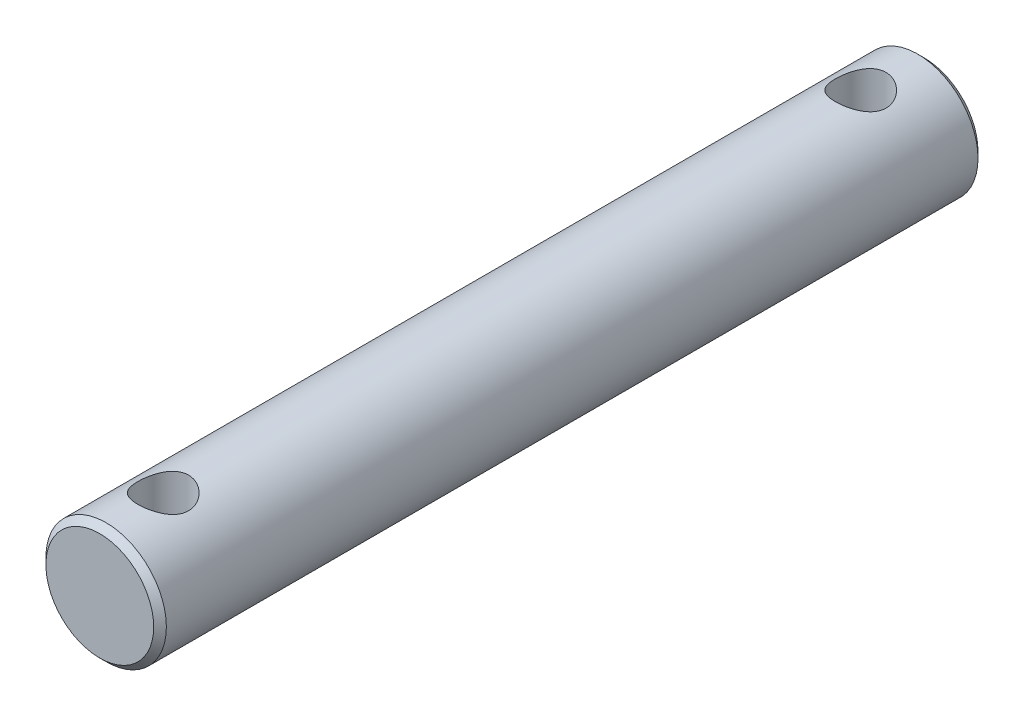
from build123d import *

# Parameters (mm, degrees)
ESQUISSE1_R             = 9.5
EXTRUSION1_DEPTH        = 130
CHANFREIN1_SIZE         = 1
ESQUISSE2_R             = 4
ENL_V_MAT_EXTRU_1_DEPTH = 65


with BuildPart() as part:
    # Esquisse1 → Extrusion1 (new body)
    with BuildSketch(Plane.XY):
        Circle(ESQUISSE1_R)
    extrude(amount=EXTRUSION1_DEPTH)

    # Chanfrein1
    chanfrein1_edges = [part.edges().sort_by_distance(p)[0] for p in [
        (-9.5, 0, 0),
        (-9.5, 0, 130),
    ]]
    chamfer(chanfrein1_edges, length=CHANFREIN1_SIZE)

    # Esquisse2 → Enl_v. mat.-Extru.1 (cut, symmetric)
    with BuildSketch(Plane(origin=(0, 0, 0), x_dir=(1, 0, 0), z_dir=(0, 1, 0))):
        with Locations(Location((0, -10, 0), (0, 0, 270))):
            Circle(ESQUISSE2_R)
        with Locations(Location((0, -120, 0), (0, 0, 270))):
            Circle(ESQUISSE2_R)
    extrude(amount=ENL_V_MAT_EXTRU_1_DEPTH, both=True, mode=Mode.SUBTRACT)


solid = part.part
